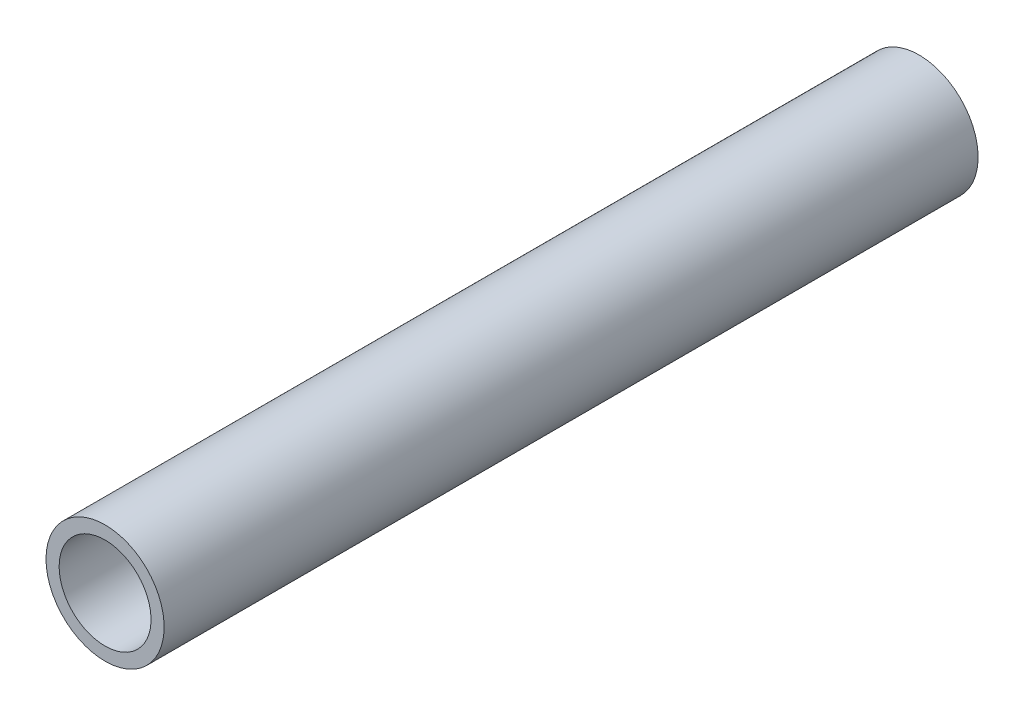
from build123d import *

# Parameters (mm, degrees)
ESQUISSE1_R        = 13.5
ESQUISSE1_R_2      = 10.5
EXTRU_MINCE1_DEPTH = 186


with BuildPart() as part:
    # Esquisse1 → Extru.-Mince1 (new body)
    with BuildSketch(Plane.XY):
        Circle(ESQUISSE1_R)
        Circle(ESQUISSE1_R_2, mode=Mode.SUBTRACT)
    extrude(amount=EXTRU_MINCE1_DEPTH)


solid = part.part
